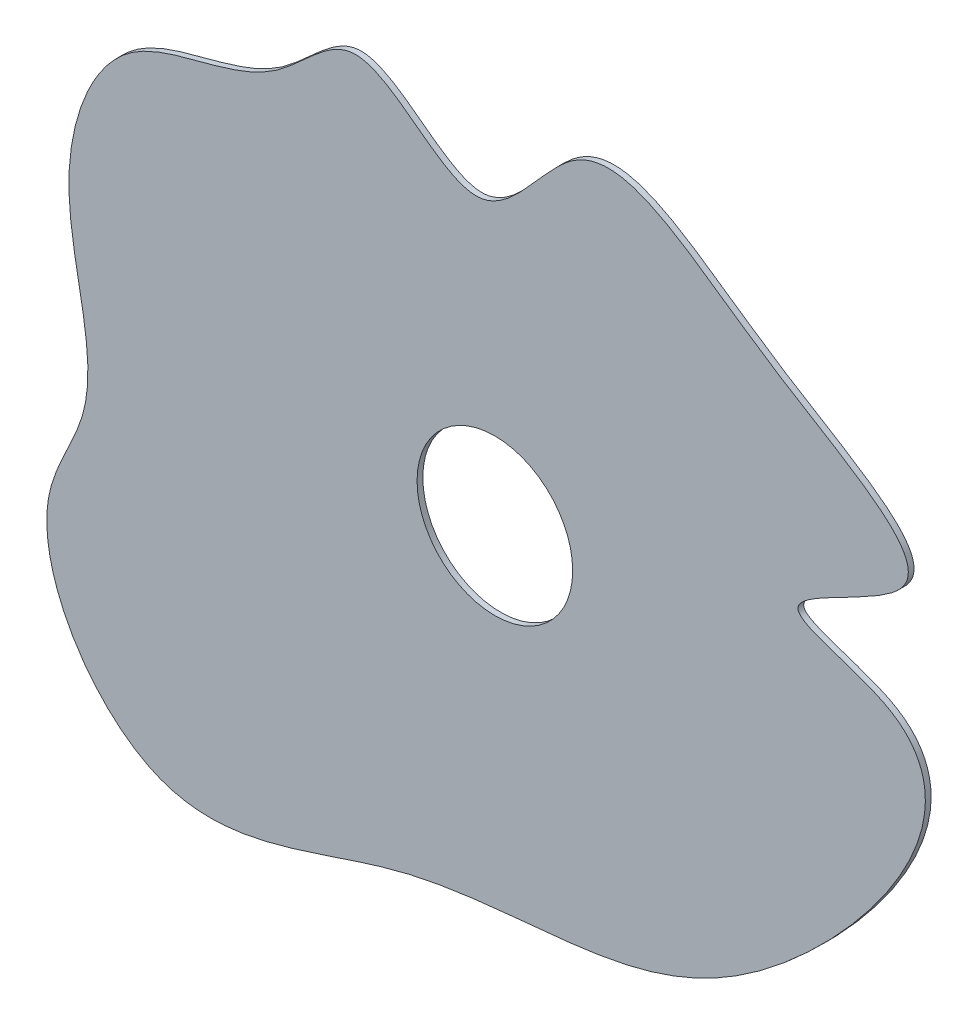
from build123d import *

# Parameters (mm, degrees)
EXTRUSION1_DEPTH = 1
ESQUISSE2_R      = 13.5
EXTRUSION2_DEPTH = 10


with BuildPart() as part:
    # Esquisse1 → Extrusion1 (new body)
    with BuildSketch(Plane.XY):
        with BuildLine():
            add(Edge.make_bspline(
                [(-21.661404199, 34.054872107), (-29.68881627, 28.41271766), (-49.835468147, 29.48904977), (-62.391909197, -3.58124952), (-49.573504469, -29.228616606), (-67.803584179, -55.185611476), (-42.802548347, -95.143511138), (-1.730499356, -71.943136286), (37.385001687, -72.963206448), (70.622595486, -58.037450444), (106.897469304, -9.732262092), (56.91584776, -2.276697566), (103.098267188, 12.042979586), (58.380278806, 33.156324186), (33.033698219, 58.865678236), (13.507817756, 22.142056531), (-6.869237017, 51.338124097), (-16.852241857, 37.435044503), (-21.661404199, 34.054872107)],
                knots=[0, 0, 0, 0, 0.057182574, 0.112713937, 0.185714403, 0.219037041, 0.298383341, 0.389371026, 0.469137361, 0.539977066, 0.643888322, 0.680328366, 0.725797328, 0.790807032, 0.870930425, 0.914966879, 0.965742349, 1, 1, 1, 1], degree=3))
        make_face()
    extrude(amount=EXTRUSION1_DEPTH)

    # Esquisse2 → Extrusion2 (cut)
    with BuildSketch(Plane(origin=(0, 0, 0), x_dir=(-1, 0, 0), z_dir=(0, 0, -1))):
        with Locations((-16.204299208, -15.470882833)):
            Circle(ESQUISSE2_R)
    extrude(amount=-EXTRUSION2_DEPTH, mode=Mode.SUBTRACT)


solid = part.part
